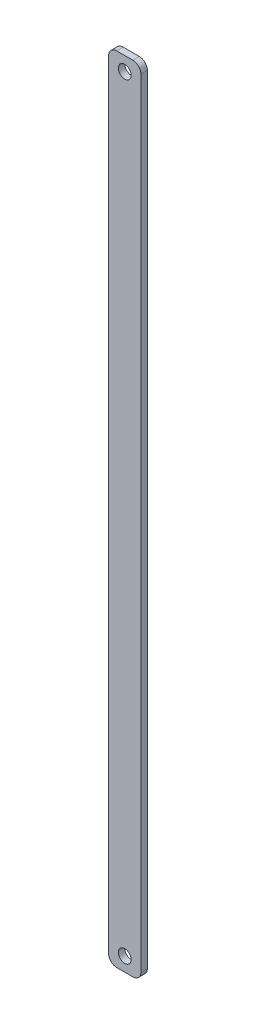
ISO-10303-21;
HEADER;
FILE_DESCRIPTION(('STEP AP214'),'2;1');
FILE_NAME('part.step','',(''),(''),'','','');
FILE_SCHEMA(('AUTOMOTIVE_DESIGN { 1 0 10303 214 1 1 1 1 }'));
ENDSEC;
DATA;
#1=APPLICATION_CONTEXT('core data for automotive mechanical design processes');
#2=APPLICATION_PROTOCOL_DEFINITION('international standard','automotive_design',2000,#1);
#3=PRODUCT_CONTEXT('',#1,'mechanical');
#4=PRODUCT('Part','Part','',(#3));
#5=PRODUCT_RELATED_PRODUCT_CATEGORY('part','',(#4));
#6=PRODUCT_DEFINITION_FORMATION('','',#4);
#7=PRODUCT_DEFINITION_CONTEXT('part definition',#1,'design');
#8=PRODUCT_DEFINITION('design','',#6,#7);
#9=PRODUCT_DEFINITION_SHAPE('','',#8);
#10=(LENGTH_UNIT() NAMED_UNIT(*) SI_UNIT(.MILLI.,.METRE.));
#11=(NAMED_UNIT(*) PLANE_ANGLE_UNIT() SI_UNIT($,.RADIAN.));
#12=(NAMED_UNIT(*) SI_UNIT($,.STERADIAN.) SOLID_ANGLE_UNIT());
#13=UNCERTAINTY_MEASURE_WITH_UNIT(LENGTH_MEASURE(1.E-05),#10,'distance_accuracy_value','');
#14=(GEOMETRIC_REPRESENTATION_CONTEXT(3) GLOBAL_UNCERTAINTY_ASSIGNED_CONTEXT((#13)) GLOBAL_UNIT_ASSIGNED_CONTEXT((#10,
#11,#12)) REPRESENTATION_CONTEXT('',''));
#15=CARTESIAN_POINT('',(0.,0.,0.));
#16=DIRECTION('',(0.,0.,1.));
#17=DIRECTION('',(1.,0.,0.));
#18=AXIS2_PLACEMENT_3D('',#15,#16,#17);
#19=CARTESIAN_POINT('',(4.035,198.37,0.815));
#20=DIRECTION('',(-1.,0.,0.));
#21=DIRECTION('',(0.,0.,1.));
#22=AXIS2_PLACEMENT_3D('',#19,#20,#21);
#23=PLANE('',#22);
#24=DIRECTION('',(0.,-1.,0.));
#25=VECTOR('',#24,1.);
#26=CARTESIAN_POINT('',(4.035,198.37,0.815));
#27=LINE('',#26,#25);
#28=CARTESIAN_POINT('',(4.035,196.37,0.815));
#29=VERTEX_POINT('',#28);
#30=CARTESIAN_POINT('',(4.035,2.,0.815));
#31=VERTEX_POINT('',#30);
#32=EDGE_CURVE('E132',#29,#31,#27,.T.);
#33=ORIENTED_EDGE('',*,*,#32,.T.);
#34=DIRECTION('',(0.,0.,-1.));
#35=VECTOR('',#34,1.);
#36=CARTESIAN_POINT('',(4.035,2.,-0.815));
#37=LINE('',#36,#35);
#38=CARTESIAN_POINT('',(4.035,2.,-0.815));
#39=VERTEX_POINT('',#38);
#40=EDGE_CURVE('E171',#31,#39,#37,.T.);
#41=ORIENTED_EDGE('',*,*,#40,.T.);
#42=DIRECTION('',(0.,-1.,0.));
#43=VECTOR('',#42,1.);
#44=CARTESIAN_POINT('',(4.035,198.37,-0.815));
#45=LINE('',#44,#43);
#46=CARTESIAN_POINT('',(4.035,196.37,-0.815));
#47=VERTEX_POINT('',#46);
#48=EDGE_CURVE('E138',#47,#39,#45,.T.);
#49=ORIENTED_EDGE('',*,*,#48,.F.);
#50=DIRECTION('',(0.,0.,-1.));
#51=VECTOR('',#50,1.);
#52=CARTESIAN_POINT('',(4.035,196.37,0.815));
#53=LINE('',#52,#51);
#54=EDGE_CURVE('E168',#47,#29,#53,.F.);
#55=ORIENTED_EDGE('',*,*,#54,.T.);
#56=EDGE_LOOP('',(#33,#41,#49,#55));
#57=FACE_BOUND('',#56,.T.);
#58=ADVANCED_FACE('F41',(#57),#23,.F.);
#59=CARTESIAN_POINT('',(-4.035,198.37,-0.815));
#60=DIRECTION('',(0.,0.,1.));
#61=DIRECTION('',(1.,0.,0.));
#62=AXIS2_PLACEMENT_3D('',#59,#60,#61);
#63=PLANE('',#62);
#64=CARTESIAN_POINT('',(-0.00500000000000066,3.49999642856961,-0.815));
#65=DIRECTION('',(0.,0.,1.));
#66=DIRECTION('',(1.,0.,0.));
#67=AXIS2_PLACEMENT_3D('',#64,#65,#66);
#68=CIRCLE('',#67,1.6);
#69=CARTESIAN_POINT('',(1.595,3.49999642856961,-0.815000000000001));
#70=VERTEX_POINT('',#69);
#71=EDGE_CURVE('E198',#70,#70,#68,.F.);
#72=ORIENTED_EDGE('',*,*,#71,.F.);
#73=EDGE_LOOP('',(#72));
#74=FACE_BOUND('',#73,.T.);
#75=CARTESIAN_POINT('',(0.00499999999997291,194.87,-0.815));
#76=DIRECTION('',(0.,0.,1.));
#77=DIRECTION('',(1.,0.,0.));
#78=AXIS2_PLACEMENT_3D('',#75,#76,#77);
#79=CIRCLE('',#78,1.59999999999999);
#80=CARTESIAN_POINT('',(1.60499999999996,194.87,-0.815000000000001));
#81=VERTEX_POINT('',#80);
#82=EDGE_CURVE('E194',#81,#81,#79,.F.);
#83=ORIENTED_EDGE('',*,*,#82,.F.);
#84=EDGE_LOOP('',(#83));
#85=FACE_BOUND('',#84,.T.);
#86=DIRECTION('',(-1.,0.,0.));
#87=VECTOR('',#86,1.);
#88=CARTESIAN_POINT('',(-4.035,0.,-0.815));
#89=LINE('',#88,#87);
#90=CARTESIAN_POINT('',(2.035,0.,-0.815));
#91=VERTEX_POINT('',#90);
#92=CARTESIAN_POINT('',(-2.035,0.,-0.815));
#93=VERTEX_POINT('',#92);
#94=EDGE_CURVE('E191',#91,#93,#89,.T.);
#95=ORIENTED_EDGE('',*,*,#94,.T.);
#96=CARTESIAN_POINT('',(-2.035,2.,-0.815));
#97=DIRECTION('',(0.,0.,1.));
#98=DIRECTION('',(1.,0.,0.));
#99=AXIS2_PLACEMENT_3D('',#96,#97,#98);
#100=CIRCLE('',#99,2.);
#101=CARTESIAN_POINT('',(-4.035,2.,-0.815));
#102=VERTEX_POINT('',#101);
#103=EDGE_CURVE('E165',#93,#102,#100,.F.);
#104=ORIENTED_EDGE('',*,*,#103,.T.);
#105=DIRECTION('',(0.,-1.,0.));
#106=VECTOR('',#105,1.);
#107=CARTESIAN_POINT('',(-4.035,198.37,-0.815));
#108=LINE('',#107,#106);
#109=CARTESIAN_POINT('',(-4.035,196.37,-0.815));
#110=VERTEX_POINT('',#109);
#111=EDGE_CURVE('E131',#110,#102,#108,.T.);
#112=ORIENTED_EDGE('',*,*,#111,.F.);
#113=CARTESIAN_POINT('',(-2.035,196.37,-0.815));
#114=DIRECTION('',(0.,0.,1.));
#115=DIRECTION('',(1.,0.,0.));
#116=AXIS2_PLACEMENT_3D('',#113,#114,#115);
#117=CIRCLE('',#116,2.);
#118=CARTESIAN_POINT('',(-2.035,198.37,-0.815));
#119=VERTEX_POINT('',#118);
#120=EDGE_CURVE('E136',#110,#119,#117,.F.);
#121=ORIENTED_EDGE('',*,*,#120,.T.);
#122=DIRECTION('',(-1.,0.,0.));
#123=VECTOR('',#122,1.);
#124=CARTESIAN_POINT('',(-4.035,198.37,-0.815));
#125=LINE('',#124,#123);
#126=CARTESIAN_POINT('',(2.035,198.37,-0.815));
#127=VERTEX_POINT('',#126);
#128=EDGE_CURVE('E179',#127,#119,#125,.T.);
#129=ORIENTED_EDGE('',*,*,#128,.F.);
#130=CARTESIAN_POINT('',(2.035,196.37,-0.815));
#131=DIRECTION('',(0.,0.,1.));
#132=DIRECTION('',(1.,0.,0.));
#133=AXIS2_PLACEMENT_3D('',#130,#131,#132);
#134=CIRCLE('',#133,2.);
#135=EDGE_CURVE('E65',#127,#47,#134,.F.);
#136=ORIENTED_EDGE('',*,*,#135,.T.);
#137=ORIENTED_EDGE('',*,*,#48,.T.);
#138=CARTESIAN_POINT('',(2.035,2.,-0.815));
#139=DIRECTION('',(0.,0.,1.));
#140=DIRECTION('',(1.,0.,0.));
#141=AXIS2_PLACEMENT_3D('',#138,#139,#140);
#142=CIRCLE('',#141,2.);
#143=EDGE_CURVE('E57',#39,#91,#142,.F.);
#144=ORIENTED_EDGE('',*,*,#143,.T.);
#145=EDGE_LOOP('',(#95,#104,#112,#121,#129,#136,#137,#144));
#146=FACE_BOUND('',#145,.T.);
#147=ADVANCED_FACE('F183',(#74,#85,#146),#63,.F.);
#148=CARTESIAN_POINT('',(-4.035,198.37,0.815));
#149=DIRECTION('',(1.,0.,0.));
#150=DIRECTION('',(0.,0.,-1.));
#151=AXIS2_PLACEMENT_3D('',#148,#149,#150);
#152=PLANE('',#151);
#153=ORIENTED_EDGE('',*,*,#111,.T.);
#154=DIRECTION('',(0.,0.,1.));
#155=VECTOR('',#154,1.);
#156=CARTESIAN_POINT('',(-4.035,2.,0.815));
#157=LINE('',#156,#155);
#158=CARTESIAN_POINT('',(-4.035,2.,0.815));
#159=VERTEX_POINT('',#158);
#160=EDGE_CURVE('E129',#102,#159,#157,.T.);
#161=ORIENTED_EDGE('',*,*,#160,.T.);
#162=DIRECTION('',(0.,-1.,0.));
#163=VECTOR('',#162,1.);
#164=CARTESIAN_POINT('',(-4.035,198.37,0.815));
#165=LINE('',#164,#163);
#166=CARTESIAN_POINT('',(-4.035,196.37,0.815));
#167=VERTEX_POINT('',#166);
#168=EDGE_CURVE('E112',#167,#159,#165,.T.);
#169=ORIENTED_EDGE('',*,*,#168,.F.);
#170=DIRECTION('',(0.,0.,1.));
#171=VECTOR('',#170,1.);
#172=CARTESIAN_POINT('',(-4.035,196.37,0.815));
#173=LINE('',#172,#171);
#174=EDGE_CURVE('E126',#167,#110,#173,.F.);
#175=ORIENTED_EDGE('',*,*,#174,.T.);
#176=EDGE_LOOP('',(#153,#161,#169,#175));
#177=FACE_BOUND('',#176,.T.);
#178=ADVANCED_FACE('F125',(#177),#152,.F.);
#179=CARTESIAN_POINT('',(-4.035,198.37,0.815));
#180=DIRECTION('',(0.,0.,-1.));
#181=DIRECTION('',(-1.,0.,0.));
#182=AXIS2_PLACEMENT_3D('',#179,#180,#181);
#183=PLANE('',#182);
#184=CARTESIAN_POINT('',(-0.00500000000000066,3.49999642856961,0.815));
#185=DIRECTION('',(0.,0.,1.));
#186=DIRECTION('',(1.,0.,0.));
#187=AXIS2_PLACEMENT_3D('',#184,#185,#186);
#188=CIRCLE('',#187,1.6);
#189=CARTESIAN_POINT('',(1.595,3.49999642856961,0.815000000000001));
#190=VERTEX_POINT('',#189);
#191=EDGE_CURVE('E319',#190,#190,#188,.T.);
#192=ORIENTED_EDGE('',*,*,#191,.F.);
#193=EDGE_LOOP('',(#192));
#194=FACE_BOUND('',#193,.T.);
#195=CARTESIAN_POINT('',(0.00499999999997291,194.87,0.815));
#196=DIRECTION('',(0.,0.,1.));
#197=DIRECTION('',(-1.,0.,0.));
#198=AXIS2_PLACEMENT_3D('',#195,#196,#197);
#199=CIRCLE('',#198,1.59999999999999);
#200=CARTESIAN_POINT('',(1.60499999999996,194.87,0.815000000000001));
#201=VERTEX_POINT('',#200);
#202=EDGE_CURVE('E322',#201,#201,#199,.T.);
#203=ORIENTED_EDGE('',*,*,#202,.F.);
#204=EDGE_LOOP('',(#203));
#205=FACE_BOUND('',#204,.T.);
#206=ORIENTED_EDGE('',*,*,#168,.T.);
#207=CARTESIAN_POINT('',(-2.035,2.,0.815));
#208=DIRECTION('',(0.,0.,-1.));
#209=DIRECTION('',(-1.,0.,0.));
#210=AXIS2_PLACEMENT_3D('',#207,#208,#209);
#211=CIRCLE('',#210,2.);
#212=CARTESIAN_POINT('',(-2.035,0.,0.815));
#213=VERTEX_POINT('',#212);
#214=EDGE_CURVE('E150',#159,#213,#211,.F.);
#215=ORIENTED_EDGE('',*,*,#214,.T.);
#216=DIRECTION('',(1.,0.,0.));
#217=VECTOR('',#216,1.);
#218=CARTESIAN_POINT('',(-4.035,0.,0.815));
#219=LINE('',#218,#217);
#220=CARTESIAN_POINT('',(2.035,0.,0.815));
#221=VERTEX_POINT('',#220);
#222=EDGE_CURVE('E185',#213,#221,#219,.T.);
#223=ORIENTED_EDGE('',*,*,#222,.T.);
#224=CARTESIAN_POINT('',(2.035,2.,0.815));
#225=DIRECTION('',(0.,0.,-1.));
#226=DIRECTION('',(-1.,0.,0.));
#227=AXIS2_PLACEMENT_3D('',#224,#225,#226);
#228=CIRCLE('',#227,2.);
#229=EDGE_CURVE('E119',#221,#31,#228,.F.);
#230=ORIENTED_EDGE('',*,*,#229,.T.);
#231=ORIENTED_EDGE('',*,*,#32,.F.);
#232=CARTESIAN_POINT('',(2.035,196.37,0.815));
#233=DIRECTION('',(0.,0.,-1.));
#234=DIRECTION('',(-1.,0.,0.));
#235=AXIS2_PLACEMENT_3D('',#232,#233,#234);
#236=CIRCLE('',#235,2.);
#237=CARTESIAN_POINT('',(2.035,198.37,0.815));
#238=VERTEX_POINT('',#237);
#239=EDGE_CURVE('E120',#29,#238,#236,.F.);
#240=ORIENTED_EDGE('',*,*,#239,.T.);
#241=DIRECTION('',(1.,0.,0.));
#242=VECTOR('',#241,1.);
#243=CARTESIAN_POINT('',(-4.035,198.37,0.815));
#244=LINE('',#243,#242);
#245=CARTESIAN_POINT('',(-2.035,198.37,0.815));
#246=VERTEX_POINT('',#245);
#247=EDGE_CURVE('E114',#246,#238,#244,.T.);
#248=ORIENTED_EDGE('',*,*,#247,.F.);
#249=CARTESIAN_POINT('',(-2.035,196.37,0.815));
#250=DIRECTION('',(0.,0.,-1.));
#251=DIRECTION('',(-1.,0.,0.));
#252=AXIS2_PLACEMENT_3D('',#249,#250,#251);
#253=CIRCLE('',#252,2.);
#254=EDGE_CURVE('E109',#246,#167,#253,.F.);
#255=ORIENTED_EDGE('',*,*,#254,.T.);
#256=EDGE_LOOP('',(#206,#215,#223,#230,#231,#240,#248,#255));
#257=FACE_BOUND('',#256,.T.);
#258=ADVANCED_FACE('F111',(#194,#205,#257),#183,.F.);
#259=CARTESIAN_POINT('',(0.,198.37,0.));
#260=DIRECTION('',(0.,-1.,0.));
#261=DIRECTION('',(0.,0.,-1.));
#262=AXIS2_PLACEMENT_3D('',#259,#260,#261);
#263=PLANE('',#262);
#264=ORIENTED_EDGE('',*,*,#128,.T.);
#265=DIRECTION('',(0.,0.,1.));
#266=VECTOR('',#265,1.);
#267=CARTESIAN_POINT('',(-2.035,198.37,0.));
#268=LINE('',#267,#266);
#269=EDGE_CURVE('E11',#119,#246,#268,.T.);
#270=ORIENTED_EDGE('',*,*,#269,.T.);
#271=ORIENTED_EDGE('',*,*,#247,.T.);
#272=DIRECTION('',(0.,0.,-1.));
#273=VECTOR('',#272,1.);
#274=CARTESIAN_POINT('',(2.035,198.37,0.));
#275=LINE('',#274,#273);
#276=EDGE_CURVE('E50',#238,#127,#275,.T.);
#277=ORIENTED_EDGE('',*,*,#276,.T.);
#278=EDGE_LOOP('',(#264,#270,#271,#277));
#279=FACE_BOUND('',#278,.T.);
#280=ADVANCED_FACE('F178',(#279),#263,.F.);
#281=CARTESIAN_POINT('',(0.,0.,0.));
#282=DIRECTION('',(0.,-1.,0.));
#283=DIRECTION('',(0.,0.,-1.));
#284=AXIS2_PLACEMENT_3D('',#281,#282,#283);
#285=PLANE('',#284);
#286=ORIENTED_EDGE('',*,*,#222,.F.);
#287=DIRECTION('',(0.,0.,1.));
#288=VECTOR('',#287,1.);
#289=CARTESIAN_POINT('',(-2.035,0.,-0.815));
#290=LINE('',#289,#288);
#291=EDGE_CURVE('E156',#213,#93,#290,.F.);
#292=ORIENTED_EDGE('',*,*,#291,.T.);
#293=ORIENTED_EDGE('',*,*,#94,.F.);
#294=DIRECTION('',(0.,0.,-1.));
#295=VECTOR('',#294,1.);
#296=CARTESIAN_POINT('',(2.035,0.,0.815));
#297=LINE('',#296,#295);
#298=EDGE_CURVE('E153',#91,#221,#297,.F.);
#299=ORIENTED_EDGE('',*,*,#298,.T.);
#300=EDGE_LOOP('',(#286,#292,#293,#299));
#301=FACE_BOUND('',#300,.T.);
#302=ADVANCED_FACE('F210',(#301),#285,.T.);
#303=CARTESIAN_POINT('',(0.00499999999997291,194.87,-5.3404833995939));
#304=DIRECTION('',(0.,0.,1.));
#305=DIRECTION('',(1.,0.,0.));
#306=AXIS2_PLACEMENT_3D('',#303,#304,#305);
#307=CYLINDRICAL_SURFACE('',#306,1.59999999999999);
#308=CARTESIAN_POINT('',(1.60499999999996,194.87,-0.815000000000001));
#309=CARTESIAN_POINT('',(1.60499999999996,194.87,-0.798020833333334));
#310=CARTESIAN_POINT('',(1.60499999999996,194.87,-0.781041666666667));
#311=CARTESIAN_POINT('',(1.60499999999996,194.87,-0.747083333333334));
#312=CARTESIAN_POINT('',(1.60499999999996,194.87,-0.730104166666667));
#313=CARTESIAN_POINT('',(1.60499999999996,194.87,-0.696145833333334));
#314=CARTESIAN_POINT('',(1.60499999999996,194.87,-0.679166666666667));
#315=CARTESIAN_POINT('',(1.60499999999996,194.87,-0.645208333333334));
#316=CARTESIAN_POINT('',(1.60499999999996,194.87,-0.628229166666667));
#317=CARTESIAN_POINT('',(1.60499999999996,194.87,-0.594270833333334));
#318=CARTESIAN_POINT('',(1.60499999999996,194.87,-0.577291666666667));
#319=CARTESIAN_POINT('',(1.60499999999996,194.87,-0.543333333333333));
#320=CARTESIAN_POINT('',(1.60499999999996,194.87,-0.526354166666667));
#321=CARTESIAN_POINT('',(1.60499999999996,194.87,-0.492395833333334));
#322=CARTESIAN_POINT('',(1.60499999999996,194.87,-0.475416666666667));
#323=CARTESIAN_POINT('',(1.60499999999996,194.87,-0.441458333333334));
#324=CARTESIAN_POINT('',(1.60499999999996,194.87,-0.424479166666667));
#325=CARTESIAN_POINT('',(1.60499999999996,194.87,-0.390520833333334));
#326=CARTESIAN_POINT('',(1.60499999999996,194.87,-0.373541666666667));
#327=CARTESIAN_POINT('',(1.60499999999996,194.87,-0.339583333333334));
#328=CARTESIAN_POINT('',(1.60499999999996,194.87,-0.322604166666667));
#329=CARTESIAN_POINT('',(1.60499999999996,194.87,-0.288645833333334));
#330=CARTESIAN_POINT('',(1.60499999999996,194.87,-0.271666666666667));
#331=CARTESIAN_POINT('',(1.60499999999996,194.87,-0.237708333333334));
#332=CARTESIAN_POINT('',(1.60499999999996,194.87,-0.220729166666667));
#333=CARTESIAN_POINT('',(1.60499999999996,194.87,-0.186770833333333));
#334=CARTESIAN_POINT('',(1.60499999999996,194.87,-0.169791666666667));
#335=CARTESIAN_POINT('',(1.60499999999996,194.87,-0.135833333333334));
#336=CARTESIAN_POINT('',(1.60499999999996,194.87,-0.118854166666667));
#337=CARTESIAN_POINT('',(1.60499999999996,194.87,-0.0848958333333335));
#338=CARTESIAN_POINT('',(1.60499999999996,194.87,-0.0679166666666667));
#339=CARTESIAN_POINT('',(1.60499999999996,194.87,-0.0339583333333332));
#340=CARTESIAN_POINT('',(1.60499999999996,194.87,-0.0169791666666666));
#341=CARTESIAN_POINT('',(1.60499999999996,194.87,0.0169791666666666));
#342=CARTESIAN_POINT('',(1.60499999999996,194.87,0.0339583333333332));
#343=CARTESIAN_POINT('',(1.60499999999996,194.87,0.0679166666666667));
#344=CARTESIAN_POINT('',(1.60499999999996,194.87,0.0848958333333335));
#345=CARTESIAN_POINT('',(1.60499999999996,194.87,0.118854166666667));
#346=CARTESIAN_POINT('',(1.60499999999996,194.87,0.135833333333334));
#347=CARTESIAN_POINT('',(1.60499999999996,194.87,0.169791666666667));
#348=CARTESIAN_POINT('',(1.60499999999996,194.87,0.186770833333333));
#349=CARTESIAN_POINT('',(1.60499999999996,194.87,0.220729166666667));
#350=CARTESIAN_POINT('',(1.60499999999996,194.87,0.237708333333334));
#351=CARTESIAN_POINT('',(1.60499999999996,194.87,0.271666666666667));
#352=CARTESIAN_POINT('',(1.60499999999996,194.87,0.288645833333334));
#353=CARTESIAN_POINT('',(1.60499999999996,194.87,0.322604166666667));
#354=CARTESIAN_POINT('',(1.60499999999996,194.87,0.339583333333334));
#355=CARTESIAN_POINT('',(1.60499999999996,194.87,0.373541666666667));
#356=CARTESIAN_POINT('',(1.60499999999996,194.87,0.390520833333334));
#357=CARTESIAN_POINT('',(1.60499999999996,194.87,0.424479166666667));
#358=CARTESIAN_POINT('',(1.60499999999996,194.87,0.441458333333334));
#359=CARTESIAN_POINT('',(1.60499999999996,194.87,0.475416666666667));
#360=CARTESIAN_POINT('',(1.60499999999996,194.87,0.492395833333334));
#361=CARTESIAN_POINT('',(1.60499999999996,194.87,0.526354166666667));
#362=CARTESIAN_POINT('',(1.60499999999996,194.87,0.543333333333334));
#363=CARTESIAN_POINT('',(1.60499999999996,194.87,0.577291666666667));
#364=CARTESIAN_POINT('',(1.60499999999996,194.87,0.594270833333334));
#365=CARTESIAN_POINT('',(1.60499999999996,194.87,0.628229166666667));
#366=CARTESIAN_POINT('',(1.60499999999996,194.87,0.645208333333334));
#367=CARTESIAN_POINT('',(1.60499999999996,194.87,0.679166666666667));
#368=CARTESIAN_POINT('',(1.60499999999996,194.87,0.696145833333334));
#369=CARTESIAN_POINT('',(1.60499999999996,194.87,0.730104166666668));
#370=CARTESIAN_POINT('',(1.60499999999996,194.87,0.747083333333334));
#371=CARTESIAN_POINT('',(1.60499999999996,194.87,0.781041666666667));
#372=CARTESIAN_POINT('',(1.60499999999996,194.87,0.798020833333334));
#373=CARTESIAN_POINT('',(1.60499999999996,194.87,0.815000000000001));
#374=B_SPLINE_CURVE_WITH_KNOTS('',3,(#308,#309,#310,#311,#312,#313,#314,#315,#316,#317,#318,
#319,#320,#321,#322,#323,#324,#325,#326,#327,#328,#329,#330,#331,#332,#333,#334,#335,#336,#337,
#338,#339,#340,#341,#342,#343,#344,#345,#346,#347,#348,#349,#350,#351,#352,#353,#354,#355,#356,
#357,#358,#359,#360,#361,#362,#363,#364,#365,#366,#367,#368,#369,#370,#371,#372,#373),
.UNSPECIFIED.,.F.,.F.,(4,2,2,2,2,2,2,2,2,2,2,2,2,2,2,2,2,2,2,2,2,2,2,2,2,2,2,2,2,2,2,2,4),(0.,
0.0509374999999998,0.101875,0.1528125,0.20375,0.254687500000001,0.305625,0.3565625,0.4075,
0.4584375,0.509375,0.5603125,0.611250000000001,0.6621875,0.713125,0.764062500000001,
0.815000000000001,0.8659375,0.916875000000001,0.967812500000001,1.01875,1.0696875,1.120625,
1.1715625,1.2225,1.2734375,1.324375,1.3753125,1.42625,1.4771875,1.528125,1.5790625,1.63),.UNSPECIFIED.);
#375=EDGE_CURVE('BSEAM262',#81,#201,#374,.T.);
#376=ORIENTED_EDGE('',*,*,#82,.T.);
#377=ORIENTED_EDGE('',*,*,#202,.T.);
#378=ORIENTED_EDGE('',*,*,#375,.T.);
#379=ORIENTED_EDGE('',*,*,#375,.F.);
#380=EDGE_LOOP('',(#376,#378,#377,#379));
#381=FACE_BOUND('',#380,.T.);
#382=ADVANCED_FACE('F262',(#381),#307,.F.);
#383=CARTESIAN_POINT('',(-0.00500000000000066,3.49999642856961,-5.3404833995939));
#384=DIRECTION('',(0.,0.,1.));
#385=DIRECTION('',(1.,0.,0.));
#386=AXIS2_PLACEMENT_3D('',#383,#384,#385);
#387=CYLINDRICAL_SURFACE('',#386,1.6);
#388=CARTESIAN_POINT('',(1.595,3.49999642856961,-0.815000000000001));
#389=CARTESIAN_POINT('',(1.595,3.49999642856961,-0.798020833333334));
#390=CARTESIAN_POINT('',(1.595,3.49999642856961,-0.781041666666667));
#391=CARTESIAN_POINT('',(1.595,3.49999642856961,-0.747083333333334));
#392=CARTESIAN_POINT('',(1.595,3.49999642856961,-0.730104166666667));
#393=CARTESIAN_POINT('',(1.595,3.49999642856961,-0.696145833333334));
#394=CARTESIAN_POINT('',(1.595,3.49999642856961,-0.679166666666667));
#395=CARTESIAN_POINT('',(1.595,3.49999642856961,-0.645208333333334));
#396=CARTESIAN_POINT('',(1.595,3.49999642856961,-0.628229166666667));
#397=CARTESIAN_POINT('',(1.595,3.49999642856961,-0.594270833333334));
#398=CARTESIAN_POINT('',(1.595,3.49999642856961,-0.577291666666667));
#399=CARTESIAN_POINT('',(1.595,3.49999642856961,-0.543333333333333));
#400=CARTESIAN_POINT('',(1.595,3.49999642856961,-0.526354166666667));
#401=CARTESIAN_POINT('',(1.595,3.49999642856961,-0.492395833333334));
#402=CARTESIAN_POINT('',(1.595,3.49999642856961,-0.475416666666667));
#403=CARTESIAN_POINT('',(1.595,3.49999642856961,-0.441458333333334));
#404=CARTESIAN_POINT('',(1.595,3.49999642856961,-0.424479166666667));
#405=CARTESIAN_POINT('',(1.595,3.49999642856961,-0.390520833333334));
#406=CARTESIAN_POINT('',(1.595,3.49999642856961,-0.373541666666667));
#407=CARTESIAN_POINT('',(1.595,3.49999642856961,-0.339583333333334));
#408=CARTESIAN_POINT('',(1.595,3.49999642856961,-0.322604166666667));
#409=CARTESIAN_POINT('',(1.595,3.49999642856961,-0.288645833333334));
#410=CARTESIAN_POINT('',(1.595,3.49999642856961,-0.271666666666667));
#411=CARTESIAN_POINT('',(1.595,3.49999642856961,-0.237708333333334));
#412=CARTESIAN_POINT('',(1.595,3.49999642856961,-0.220729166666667));
#413=CARTESIAN_POINT('',(1.595,3.49999642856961,-0.186770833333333));
#414=CARTESIAN_POINT('',(1.595,3.49999642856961,-0.169791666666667));
#415=CARTESIAN_POINT('',(1.595,3.49999642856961,-0.135833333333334));
#416=CARTESIAN_POINT('',(1.595,3.49999642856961,-0.118854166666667));
#417=CARTESIAN_POINT('',(1.595,3.49999642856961,-0.0848958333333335));
#418=CARTESIAN_POINT('',(1.595,3.49999642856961,-0.0679166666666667));
#419=CARTESIAN_POINT('',(1.595,3.49999642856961,-0.0339583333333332));
#420=CARTESIAN_POINT('',(1.595,3.49999642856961,-0.0169791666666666));
#421=CARTESIAN_POINT('',(1.595,3.49999642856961,0.0169791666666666));
#422=CARTESIAN_POINT('',(1.595,3.49999642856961,0.0339583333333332));
#423=CARTESIAN_POINT('',(1.595,3.49999642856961,0.0679166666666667));
#424=CARTESIAN_POINT('',(1.595,3.49999642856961,0.0848958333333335));
#425=CARTESIAN_POINT('',(1.595,3.49999642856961,0.118854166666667));
#426=CARTESIAN_POINT('',(1.595,3.49999642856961,0.135833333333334));
#427=CARTESIAN_POINT('',(1.595,3.49999642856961,0.169791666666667));
#428=CARTESIAN_POINT('',(1.595,3.49999642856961,0.186770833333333));
#429=CARTESIAN_POINT('',(1.595,3.49999642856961,0.220729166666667));
#430=CARTESIAN_POINT('',(1.595,3.49999642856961,0.237708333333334));
#431=CARTESIAN_POINT('',(1.595,3.49999642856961,0.271666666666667));
#432=CARTESIAN_POINT('',(1.595,3.49999642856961,0.288645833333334));
#433=CARTESIAN_POINT('',(1.595,3.49999642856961,0.322604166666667));
#434=CARTESIAN_POINT('',(1.595,3.49999642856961,0.339583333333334));
#435=CARTESIAN_POINT('',(1.595,3.49999642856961,0.373541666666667));
#436=CARTESIAN_POINT('',(1.595,3.49999642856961,0.390520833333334));
#437=CARTESIAN_POINT('',(1.595,3.49999642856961,0.424479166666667));
#438=CARTESIAN_POINT('',(1.595,3.49999642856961,0.441458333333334));
#439=CARTESIAN_POINT('',(1.595,3.49999642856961,0.475416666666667));
#440=CARTESIAN_POINT('',(1.595,3.49999642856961,0.492395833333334));
#441=CARTESIAN_POINT('',(1.595,3.49999642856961,0.526354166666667));
#442=CARTESIAN_POINT('',(1.595,3.49999642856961,0.543333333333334));
#443=CARTESIAN_POINT('',(1.595,3.49999642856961,0.577291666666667));
#444=CARTESIAN_POINT('',(1.595,3.49999642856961,0.594270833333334));
#445=CARTESIAN_POINT('',(1.595,3.49999642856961,0.628229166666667));
#446=CARTESIAN_POINT('',(1.595,3.49999642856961,0.645208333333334));
#447=CARTESIAN_POINT('',(1.595,3.49999642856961,0.679166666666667));
#448=CARTESIAN_POINT('',(1.595,3.49999642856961,0.696145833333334));
#449=CARTESIAN_POINT('',(1.595,3.49999642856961,0.730104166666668));
#450=CARTESIAN_POINT('',(1.595,3.49999642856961,0.747083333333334));
#451=CARTESIAN_POINT('',(1.595,3.49999642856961,0.781041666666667));
#452=CARTESIAN_POINT('',(1.595,3.49999642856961,0.798020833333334));
#453=CARTESIAN_POINT('',(1.595,3.49999642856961,0.815000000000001));
#454=B_SPLINE_CURVE_WITH_KNOTS('',3,(#388,#389,#390,#391,#392,#393,#394,#395,#396,#397,#398,
#399,#400,#401,#402,#403,#404,#405,#406,#407,#408,#409,#410,#411,#412,#413,#414,#415,#416,#417,
#418,#419,#420,#421,#422,#423,#424,#425,#426,#427,#428,#429,#430,#431,#432,#433,#434,#435,#436,
#437,#438,#439,#440,#441,#442,#443,#444,#445,#446,#447,#448,#449,#450,#451,#452,#453),
.UNSPECIFIED.,.F.,.F.,(4,2,2,2,2,2,2,2,2,2,2,2,2,2,2,2,2,2,2,2,2,2,2,2,2,2,2,2,2,2,2,2,4),(0.,
0.0509374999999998,0.101875,0.1528125,0.20375,0.254687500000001,0.305625,0.3565625,0.4075,
0.4584375,0.509375,0.5603125,0.611250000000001,0.6621875,0.713125,0.764062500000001,
0.815000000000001,0.8659375,0.916875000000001,0.967812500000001,1.01875,1.0696875,1.120625,
1.1715625,1.2225,1.2734375,1.324375,1.3753125,1.42625,1.4771875,1.528125,1.5790625,1.63),.UNSPECIFIED.);
#455=EDGE_CURVE('BSEAM231',#70,#190,#454,.T.);
#456=ORIENTED_EDGE('',*,*,#71,.T.);
#457=ORIENTED_EDGE('',*,*,#191,.T.);
#458=ORIENTED_EDGE('',*,*,#455,.T.);
#459=ORIENTED_EDGE('',*,*,#455,.F.);
#460=EDGE_LOOP('',(#456,#458,#457,#459));
#461=FACE_BOUND('',#460,.T.);
#462=ADVANCED_FACE('F231',(#461),#387,.F.);
#463=CARTESIAN_POINT('',(-2.035,2.,0.815));
#464=DIRECTION('',(0.,0.,-1.));
#465=DIRECTION('',(-1.,0.,0.));
#466=AXIS2_PLACEMENT_3D('',#463,#464,#465);
#467=CYLINDRICAL_SURFACE('',#466,2.);
#468=ORIENTED_EDGE('',*,*,#103,.F.);
#469=ORIENTED_EDGE('',*,*,#291,.F.);
#470=ORIENTED_EDGE('',*,*,#214,.F.);
#471=ORIENTED_EDGE('',*,*,#160,.F.);
#472=EDGE_LOOP('',(#468,#469,#470,#471));
#473=FACE_BOUND('',#472,.T.);
#474=ADVANCED_FACE('F205',(#473),#467,.T.);
#475=CARTESIAN_POINT('',(2.035,2.,0.815));
#476=DIRECTION('',(0.,0.,1.));
#477=DIRECTION('',(1.,0.,0.));
#478=AXIS2_PLACEMENT_3D('',#475,#476,#477);
#479=CYLINDRICAL_SURFACE('',#478,2.);
#480=ORIENTED_EDGE('',*,*,#229,.F.);
#481=ORIENTED_EDGE('',*,*,#298,.F.);
#482=ORIENTED_EDGE('',*,*,#143,.F.);
#483=ORIENTED_EDGE('',*,*,#40,.F.);
#484=EDGE_LOOP('',(#480,#481,#482,#483));
#485=FACE_BOUND('',#484,.T.);
#486=ADVANCED_FACE('F212',(#485),#479,.T.);
#487=CARTESIAN_POINT('',(-2.035,196.37,0.));
#488=DIRECTION('',(0.,0.,1.));
#489=DIRECTION('',(1.,0.,0.));
#490=AXIS2_PLACEMENT_3D('',#487,#488,#489);
#491=CYLINDRICAL_SURFACE('',#490,2.);
#492=ORIENTED_EDGE('',*,*,#120,.F.);
#493=ORIENTED_EDGE('',*,*,#174,.F.);
#494=ORIENTED_EDGE('',*,*,#254,.F.);
#495=ORIENTED_EDGE('',*,*,#269,.F.);
#496=EDGE_LOOP('',(#492,#493,#494,#495));
#497=FACE_BOUND('',#496,.T.);
#498=ADVANCED_FACE('F135',(#497),#491,.T.);
#499=CARTESIAN_POINT('',(2.035,196.37,0.));
#500=DIRECTION('',(0.,0.,-1.));
#501=DIRECTION('',(-1.,0.,0.));
#502=AXIS2_PLACEMENT_3D('',#499,#500,#501);
#503=CYLINDRICAL_SURFACE('',#502,2.);
#504=ORIENTED_EDGE('',*,*,#239,.F.);
#505=ORIENTED_EDGE('',*,*,#54,.F.);
#506=ORIENTED_EDGE('',*,*,#135,.F.);
#507=ORIENTED_EDGE('',*,*,#276,.F.);
#508=EDGE_LOOP('',(#504,#505,#506,#507));
#509=FACE_BOUND('',#508,.T.);
#510=ADVANCED_FACE('F43',(#509),#503,.T.);
#511=CLOSED_SHELL('',(#58,#147,#178,#258,#280,#302,#382,#462,#474,#486,#498,#510));
#512=MANIFOLD_SOLID_BREP('B2',#511);
#513=ADVANCED_BREP_SHAPE_REPRESENTATION('',(#18,#512),#14);
#514=SHAPE_DEFINITION_REPRESENTATION(#9,#513);
ENDSEC;
END-ISO-10303-21;
